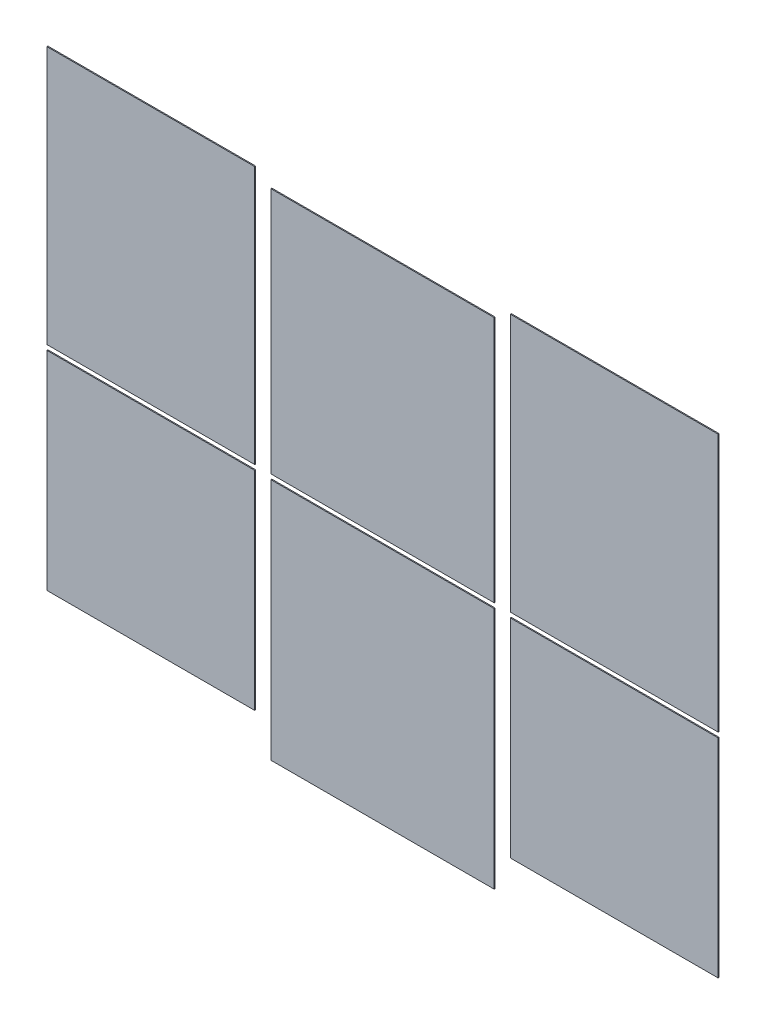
from build123d import *

# Parameters (mm, degrees)
SKETCH1_W             = 830
SKETCH1_H             = 1030
BOSS_EXTRUDE1_DEPTH   = 4
SKETCH1_H_2           = 830
BOSS_EXTRUDE1_2_DEPTH = 4
SKETCH1_W_2           = 892
SKETCH1_H_3           = 970
BOSS_EXTRUDE1_3_DEPTH = 4
SKETCH1_H_4           = 986
BOSS_EXTRUDE1_4_DEPTH = 4
BOSS_EXTRUDE1_5_DEPTH = 4
BOSS_EXTRUDE1_6_DEPTH = 4


with BuildPart() as part:
    # Sketch1 → Boss-Extrude1 (new body)
    with BuildSketch(Plane(origin=(0, 0, 4.1), x_dir=(-1, 0, 0), z_dir=(0, 0, -1))):
        with Locations((-917.496631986, 525.435100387)):
            Rectangle(SKETCH1_W, SKETCH1_H)
    extrude(amount=BOSS_EXTRUDE1_DEPTH)


with BuildPart() as body_2:
    # Sketch1 → Boss-Extrude1 2 (new body)
    with BuildSketch(Plane(origin=(0, 0, 4.1), x_dir=(-1, 0, 0), z_dir=(0, 0, -1))):
        with Locations((-917.496631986, -424.564899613)):
            Rectangle(SKETCH1_W, SKETCH1_H_2)
    extrude(amount=BOSS_EXTRUDE1_2_DEPTH)


with BuildPart() as body_3:
    # Sketch1 → Boss-Extrude1 3 (new body)
    with BuildSketch(Plane(origin=(0, 0, 4.1), x_dir=(-1, 0, 0), z_dir=(0, 0, -1))):
        with Locations((7.503368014, -494.564899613)):
            Rectangle(SKETCH1_W_2, SKETCH1_H_3)
    extrude(amount=BOSS_EXTRUDE1_3_DEPTH)


with BuildPart() as body_4:
    # Sketch1 → Boss-Extrude1 4 (new body)
    with BuildSketch(Plane(origin=(0, 0, 4.1), x_dir=(-1, 0, 0), z_dir=(0, 0, -1))):
        with Locations((7.503368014, 503.435100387)):
            Rectangle(SKETCH1_W_2, SKETCH1_H_4)
    extrude(amount=BOSS_EXTRUDE1_4_DEPTH)


with BuildPart() as body_5:
    # Sketch1 → Boss-Extrude1 5 (new body)
    with BuildSketch(Plane(origin=(0, 0, 4.1), x_dir=(-1, 0, 0), z_dir=(0, 0, -1))):
        with Locations((932.503368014, -424.564899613)):
            Rectangle(SKETCH1_W, SKETCH1_H_2)
    extrude(amount=BOSS_EXTRUDE1_5_DEPTH)


with BuildPart() as body_6:
    # Sketch1 → Boss-Extrude1 6 (new body)
    with BuildSketch(Plane(origin=(0, 0, 4.1), x_dir=(-1, 0, 0), z_dir=(0, 0, -1))):
        with Locations((932.503368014, 525.435100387)):
            Rectangle(SKETCH1_W, SKETCH1_H)
    extrude(amount=BOSS_EXTRUDE1_6_DEPTH)


solid = Compound([part.part, body_2.part, body_3.part, body_4.part, body_5.part, body_6.part])
